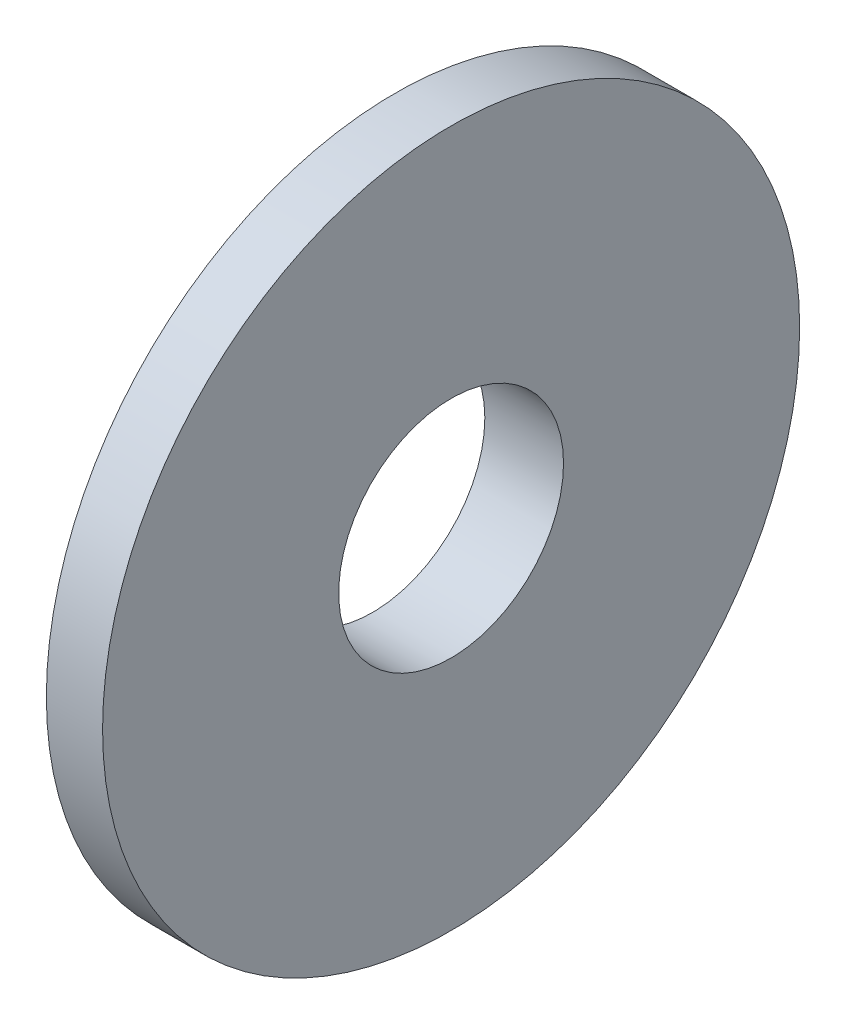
ISO-10303-21;
HEADER;
FILE_DESCRIPTION(('STEP AP214'),'2;1');
FILE_NAME('part.step','',(''),(''),'','','');
FILE_SCHEMA(('AUTOMOTIVE_DESIGN { 1 0 10303 214 1 1 1 1 }'));
ENDSEC;
DATA;
#1=APPLICATION_CONTEXT('core data for automotive mechanical design processes');
#2=APPLICATION_PROTOCOL_DEFINITION('international standard','automotive_design',2000,#1);
#3=PRODUCT_CONTEXT('',#1,'mechanical');
#4=PRODUCT('Part','Part','',(#3));
#5=PRODUCT_RELATED_PRODUCT_CATEGORY('part','',(#4));
#6=PRODUCT_DEFINITION_FORMATION('','',#4);
#7=PRODUCT_DEFINITION_CONTEXT('part definition',#1,'design');
#8=PRODUCT_DEFINITION('design','',#6,#7);
#9=PRODUCT_DEFINITION_SHAPE('','',#8);
#10=(LENGTH_UNIT() NAMED_UNIT(*) SI_UNIT(.MILLI.,.METRE.));
#11=(NAMED_UNIT(*) PLANE_ANGLE_UNIT() SI_UNIT($,.RADIAN.));
#12=(NAMED_UNIT(*) SI_UNIT($,.STERADIAN.) SOLID_ANGLE_UNIT());
#13=UNCERTAINTY_MEASURE_WITH_UNIT(LENGTH_MEASURE(1.E-05),#10,'distance_accuracy_value','');
#14=(GEOMETRIC_REPRESENTATION_CONTEXT(3) GLOBAL_UNCERTAINTY_ASSIGNED_CONTEXT((#13)) GLOBAL_UNIT_ASSIGNED_CONTEXT((#10,
#11,#12)) REPRESENTATION_CONTEXT('',''));
#15=CARTESIAN_POINT('',(0.,0.,0.));
#16=DIRECTION('',(0.,0.,1.));
#17=DIRECTION('',(1.,0.,0.));
#18=AXIS2_PLACEMENT_3D('',#15,#16,#17);
#19=CARTESIAN_POINT('',(14.9999999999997,0.,0.));
#20=DIRECTION('',(1.,0.,0.));
#21=DIRECTION('',(0.,0.,-1.));
#22=AXIS2_PLACEMENT_3D('',#19,#20,#21);
#23=PLANE('',#22);
#24=CARTESIAN_POINT('',(14.9999999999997,0.,0.));
#25=DIRECTION('',(1.,0.,0.));
#26=DIRECTION('',(0.,0.,-1.));
#27=AXIS2_PLACEMENT_3D('',#24,#25,#26);
#28=CIRCLE('',#27,10.);
#29=CARTESIAN_POINT('',(14.9999999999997,0.,-10.));
#30=VERTEX_POINT('',#29);
#31=EDGE_CURVE('E33',#30,#30,#28,.T.);
#32=ORIENTED_EDGE('',*,*,#31,.T.);
#33=EDGE_LOOP('',(#32));
#34=FACE_BOUND('',#33,.T.);
#35=CARTESIAN_POINT('',(14.9999999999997,0.,0.));
#36=DIRECTION('',(-1.,0.,0.));
#37=DIRECTION('',(0.,0.,1.));
#38=AXIS2_PLACEMENT_3D('',#35,#36,#37);
#39=CIRCLE('',#38,19.);
#40=CARTESIAN_POINT('',(14.9999999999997,0.,19.));
#41=VERTEX_POINT('',#40);
#42=EDGE_CURVE('E10',#41,#41,#39,.T.);
#43=ORIENTED_EDGE('',*,*,#42,.T.);
#44=EDGE_LOOP('',(#43));
#45=FACE_BOUND('',#44,.T.);
#46=ADVANCED_FACE('F14',(#34,#45),#23,.F.);
#47=CARTESIAN_POINT('',(0.,0.,0.));
#48=DIRECTION('',(-1.,0.,0.));
#49=DIRECTION('',(0.,0.,1.));
#50=AXIS2_PLACEMENT_3D('',#47,#48,#49);
#51=CYLINDRICAL_SURFACE('',#50,19.);
#52=ORIENTED_EDGE('',*,*,#42,.F.);
#53=EDGE_LOOP('',(#52));
#54=FACE_BOUND('',#53,.T.);
#55=CARTESIAN_POINT('',(16.9999999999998,0.,0.));
#56=DIRECTION('',(-1.,0.,0.));
#57=DIRECTION('',(0.,0.,1.));
#58=AXIS2_PLACEMENT_3D('',#55,#56,#57);
#59=CIRCLE('',#58,19.);
#60=CARTESIAN_POINT('',(16.9999999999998,0.,19.));
#61=VERTEX_POINT('',#60);
#62=EDGE_CURVE('E20',#61,#61,#59,.T.);
#63=ORIENTED_EDGE('',*,*,#62,.T.);
#64=EDGE_LOOP('',(#63));
#65=FACE_BOUND('',#64,.T.);
#66=ADVANCED_FACE('F63',(#54,#65),#51,.T.);
#67=CARTESIAN_POINT('',(16.9999999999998,19.,0.));
#68=DIRECTION('',(1.,0.,0.));
#69=DIRECTION('',(0.,0.,-1.));
#70=AXIS2_PLACEMENT_3D('',#67,#68,#69);
#71=PLANE('',#70);
#72=ORIENTED_EDGE('',*,*,#62,.F.);
#73=EDGE_LOOP('',(#72));
#74=FACE_BOUND('',#73,.T.);
#75=CARTESIAN_POINT('',(16.9999999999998,0.,0.));
#76=DIRECTION('',(-1.,0.,0.));
#77=DIRECTION('',(0.,0.,1.));
#78=AXIS2_PLACEMENT_3D('',#75,#76,#77);
#79=CIRCLE('',#78,31.);
#80=CARTESIAN_POINT('',(16.9999999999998,0.,31.));
#81=VERTEX_POINT('',#80);
#82=EDGE_CURVE('E24',#81,#81,#79,.T.);
#83=ORIENTED_EDGE('',*,*,#82,.T.);
#84=EDGE_LOOP('',(#83));
#85=FACE_BOUND('',#84,.T.);
#86=ADVANCED_FACE('F55',(#74,#85),#71,.F.);
#87=CARTESIAN_POINT('',(0.,0.,0.));
#88=DIRECTION('',(-1.,0.,0.));
#89=DIRECTION('',(0.,0.,1.));
#90=AXIS2_PLACEMENT_3D('',#87,#88,#89);
#91=CYLINDRICAL_SURFACE('',#90,31.);
#92=ORIENTED_EDGE('',*,*,#82,.F.);
#93=EDGE_LOOP('',(#92));
#94=FACE_BOUND('',#93,.T.);
#95=CARTESIAN_POINT('',(21.9999999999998,0.,0.));
#96=DIRECTION('',(-1.,0.,0.));
#97=DIRECTION('',(0.,0.,1.));
#98=AXIS2_PLACEMENT_3D('',#95,#96,#97);
#99=CIRCLE('',#98,31.);
#100=CARTESIAN_POINT('',(21.9999999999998,0.,31.));
#101=VERTEX_POINT('',#100);
#102=EDGE_CURVE('E28',#101,#101,#99,.T.);
#103=ORIENTED_EDGE('',*,*,#102,.T.);
#104=EDGE_LOOP('',(#103));
#105=FACE_BOUND('',#104,.T.);
#106=ADVANCED_FACE('F50',(#94,#105),#91,.T.);
#107=CARTESIAN_POINT('',(21.9999999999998,31.,0.));
#108=DIRECTION('',(-1.,0.,0.));
#109=DIRECTION('',(0.,0.,1.));
#110=AXIS2_PLACEMENT_3D('',#107,#108,#109);
#111=PLANE('',#110);
#112=CARTESIAN_POINT('',(21.9999999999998,0.,0.));
#113=DIRECTION('',(1.,0.,0.));
#114=DIRECTION('',(0.,0.,-1.));
#115=AXIS2_PLACEMENT_3D('',#112,#113,#114);
#116=CIRCLE('',#115,10.);
#117=CARTESIAN_POINT('',(21.9999999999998,0.,-10.));
#118=VERTEX_POINT('',#117);
#119=EDGE_CURVE('E34',#118,#118,#116,.T.);
#120=ORIENTED_EDGE('',*,*,#119,.F.);
#121=EDGE_LOOP('',(#120));
#122=FACE_BOUND('',#121,.T.);
#123=ORIENTED_EDGE('',*,*,#102,.F.);
#124=EDGE_LOOP('',(#123));
#125=FACE_BOUND('',#124,.T.);
#126=ADVANCED_FACE('F44',(#122,#125),#111,.F.);
#127=CARTESIAN_POINT('',(14.9999999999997,0.,0.));
#128=DIRECTION('',(1.,0.,0.));
#129=DIRECTION('',(0.,0.,-1.));
#130=AXIS2_PLACEMENT_3D('',#127,#128,#129);
#131=CYLINDRICAL_SURFACE('',#130,10.);
#132=ORIENTED_EDGE('',*,*,#31,.F.);
#133=EDGE_LOOP('',(#132));
#134=FACE_BOUND('',#133,.T.);
#135=ORIENTED_EDGE('',*,*,#119,.T.);
#136=EDGE_LOOP('',(#135));
#137=FACE_BOUND('',#136,.T.);
#138=ADVANCED_FACE('F41',(#134,#137),#131,.F.);
#139=CLOSED_SHELL('',(#46,#66,#86,#106,#126,#138));
#140=MANIFOLD_SOLID_BREP('B1',#139);
#141=ADVANCED_BREP_SHAPE_REPRESENTATION('',(#18,#140),#14);
#142=SHAPE_DEFINITION_REPRESENTATION(#9,#141);
ENDSEC;
END-ISO-10303-21;
